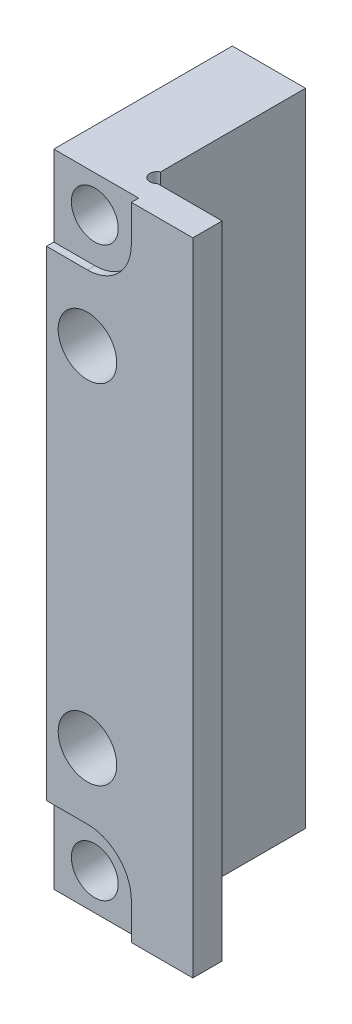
ISO-10303-21;
HEADER;
FILE_DESCRIPTION(('STEP AP214'),'2;1');
FILE_NAME('part.step','',(''),(''),'','','');
FILE_SCHEMA(('AUTOMOTIVE_DESIGN { 1 0 10303 214 1 1 1 1 }'));
ENDSEC;
DATA;
#1=APPLICATION_CONTEXT('core data for automotive mechanical design processes');
#2=APPLICATION_PROTOCOL_DEFINITION('international standard','automotive_design',2000,#1);
#3=PRODUCT_CONTEXT('',#1,'mechanical');
#4=PRODUCT('Part','Part','',(#3));
#5=PRODUCT_RELATED_PRODUCT_CATEGORY('part','',(#4));
#6=PRODUCT_DEFINITION_FORMATION('','',#4);
#7=PRODUCT_DEFINITION_CONTEXT('part definition',#1,'design');
#8=PRODUCT_DEFINITION('design','',#6,#7);
#9=PRODUCT_DEFINITION_SHAPE('','',#8);
#10=(LENGTH_UNIT() NAMED_UNIT(*) SI_UNIT(.MILLI.,.METRE.));
#11=(NAMED_UNIT(*) PLANE_ANGLE_UNIT() SI_UNIT($,.RADIAN.));
#12=(NAMED_UNIT(*) SI_UNIT($,.STERADIAN.) SOLID_ANGLE_UNIT());
#13=UNCERTAINTY_MEASURE_WITH_UNIT(LENGTH_MEASURE(1.E-05),#10,'distance_accuracy_value','');
#14=(GEOMETRIC_REPRESENTATION_CONTEXT(3) GLOBAL_UNCERTAINTY_ASSIGNED_CONTEXT((#13)) GLOBAL_UNIT_ASSIGNED_CONTEXT((#10,
#11,#12)) REPRESENTATION_CONTEXT('',''));
#15=CARTESIAN_POINT('',(0.,0.,0.));
#16=DIRECTION('',(0.,0.,1.));
#17=DIRECTION('',(1.,0.,0.));
#18=AXIS2_PLACEMENT_3D('',#15,#16,#17);
#19=CARTESIAN_POINT('',(-34.9,21.9,-10.));
#20=DIRECTION('',(-1.,0.,0.));
#21=DIRECTION('',(0.,0.,1.));
#22=AXIS2_PLACEMENT_3D('',#19,#20,#21);
#23=PLANE('',#22);
#24=DIRECTION('',(0.,0.,1.));
#25=VECTOR('',#24,1.);
#26=CARTESIAN_POINT('',(-34.9,16.4,-0.5));
#27=LINE('',#26,#25);
#28=CARTESIAN_POINT('',(-34.9,16.4,-0.5));
#29=VERTEX_POINT('',#28);
#30=CARTESIAN_POINT('',(-34.9,16.4,0.));
#31=VERTEX_POINT('',#30);
#32=EDGE_CURVE('E248',#29,#31,#27,.T.);
#33=ORIENTED_EDGE('',*,*,#32,.F.);
#34=DIRECTION('',(0.,-1.,0.));
#35=VECTOR('',#34,1.);
#36=CARTESIAN_POINT('',(-34.9,16.4,-0.5));
#37=LINE('',#36,#35);
#38=CARTESIAN_POINT('',(-34.9,21.9,-0.5));
#39=VERTEX_POINT('',#38);
#40=EDGE_CURVE('E228',#39,#29,#37,.T.);
#41=ORIENTED_EDGE('',*,*,#40,.F.);
#42=DIRECTION('',(0.,0.,1.));
#43=VECTOR('',#42,1.);
#44=CARTESIAN_POINT('',(-34.9,21.9,-10.));
#45=LINE('',#44,#43);
#46=CARTESIAN_POINT('',(-34.9,21.9,-12.7));
#47=VERTEX_POINT('',#46);
#48=EDGE_CURVE('E12',#47,#39,#45,.T.);
#49=ORIENTED_EDGE('',*,*,#48,.F.);
#50=DIRECTION('',(0.,1.,0.));
#51=VECTOR('',#50,1.);
#52=CARTESIAN_POINT('',(-34.9,-21.9,-12.7));
#53=LINE('',#52,#51);
#54=CARTESIAN_POINT('',(-34.9,-21.9,-12.7));
#55=VERTEX_POINT('',#54);
#56=EDGE_CURVE('E201',#55,#47,#53,.T.);
#57=ORIENTED_EDGE('',*,*,#56,.F.);
#58=DIRECTION('',(0.,0.,1.));
#59=VECTOR('',#58,1.);
#60=CARTESIAN_POINT('',(-34.9,-21.9,-10.));
#61=LINE('',#60,#59);
#62=CARTESIAN_POINT('',(-34.9,-21.9,-0.5));
#63=VERTEX_POINT('',#62);
#64=EDGE_CURVE('E341',#55,#63,#61,.T.);
#65=ORIENTED_EDGE('',*,*,#64,.T.);
#66=DIRECTION('',(0.,-1.,0.));
#67=VECTOR('',#66,1.);
#68=CARTESIAN_POINT('',(-34.9,-16.4,-0.5));
#69=LINE('',#68,#67);
#70=CARTESIAN_POINT('',(-34.9,-16.4,-0.5));
#71=VERTEX_POINT('',#70);
#72=EDGE_CURVE('E285',#71,#63,#69,.T.);
#73=ORIENTED_EDGE('',*,*,#72,.F.);
#74=DIRECTION('',(0.,0.,1.));
#75=VECTOR('',#74,1.);
#76=CARTESIAN_POINT('',(-34.9,-16.4,-0.5));
#77=LINE('',#76,#75);
#78=CARTESIAN_POINT('',(-34.9,-16.4,0.));
#79=VERTEX_POINT('',#78);
#80=EDGE_CURVE('E260',#71,#79,#77,.T.);
#81=ORIENTED_EDGE('',*,*,#80,.T.);
#82=DIRECTION('',(0.,-1.,0.));
#83=VECTOR('',#82,1.);
#84=CARTESIAN_POINT('',(-34.9,21.9,0.));
#85=LINE('',#84,#83);
#86=EDGE_CURVE('E327',#31,#79,#85,.T.);
#87=ORIENTED_EDGE('',*,*,#86,.F.);
#88=EDGE_LOOP('',(#33,#41,#49,#57,#65,#73,#81,#87));
#89=FACE_BOUND('',#88,.T.);
#90=ADVANCED_FACE('F62',(#89),#23,.T.);
#91=CARTESIAN_POINT('',(-34.9,21.9,-10.));
#92=DIRECTION('',(0.,1.,0.));
#93=DIRECTION('',(-1.,0.,0.));
#94=AXIS2_PLACEMENT_3D('',#91,#92,#93);
#95=PLANE('',#94);
#96=DIRECTION('',(0.,0.,1.));
#97=VECTOR('',#96,1.);
#98=CARTESIAN_POINT('',(-29.1,21.9,-0.5));
#99=LINE('',#98,#97);
#100=CARTESIAN_POINT('',(-29.1,21.9,-0.5));
#101=VERTEX_POINT('',#100);
#102=CARTESIAN_POINT('',(-29.1,21.9,0.));
#103=VERTEX_POINT('',#102);
#104=EDGE_CURVE('E251',#101,#103,#99,.T.);
#105=ORIENTED_EDGE('',*,*,#104,.T.);
#106=DIRECTION('',(-1.,0.,0.));
#107=VECTOR('',#106,1.);
#108=CARTESIAN_POINT('',(-34.9,21.9,0.));
#109=LINE('',#108,#107);
#110=CARTESIAN_POINT('',(-24.9,21.9,0.));
#111=VERTEX_POINT('',#110);
#112=EDGE_CURVE('E338',#111,#103,#109,.T.);
#113=ORIENTED_EDGE('',*,*,#112,.F.);
#114=DIRECTION('',(0.,0.,1.));
#115=VECTOR('',#114,1.);
#116=CARTESIAN_POINT('',(-24.9,21.9,-10.));
#117=LINE('',#116,#115);
#118=CARTESIAN_POINT('',(-24.8999999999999,21.9,-2.));
#119=VERTEX_POINT('',#118);
#120=EDGE_CURVE('E71',#119,#111,#117,.T.);
#121=ORIENTED_EDGE('',*,*,#120,.F.);
#122=DIRECTION('',(-1.,0.,0.));
#123=VECTOR('',#122,1.);
#124=CARTESIAN_POINT('',(0.,21.8999999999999,-2.));
#125=LINE('',#124,#123);
#126=CARTESIAN_POINT('',(-29.3226741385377,21.9,-2.));
#127=VERTEX_POINT('',#126);
#128=EDGE_CURVE('E183',#119,#127,#125,.T.);
#129=ORIENTED_EDGE('',*,*,#128,.T.);
#130=CARTESIAN_POINT('',(-29.6839888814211,21.9,-2.34561778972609));
#131=DIRECTION('',(0.,-1.,0.));
#132=DIRECTION('',(1.,0.,0.));
#133=AXIS2_PLACEMENT_3D('',#130,#131,#132);
#134=CIRCLE('',#133,0.499999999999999);
#135=CARTESIAN_POINT('',(-29.8999999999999,21.9,-2.79654926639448));
#136=VERTEX_POINT('',#135);
#137=EDGE_CURVE('E180',#127,#136,#134,.T.);
#138=ORIENTED_EDGE('',*,*,#137,.T.);
#139=DIRECTION('',(0.,0.,-1.));
#140=VECTOR('',#139,1.);
#141=CARTESIAN_POINT('',(-29.8999999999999,21.9,0.));
#142=LINE('',#141,#140);
#143=CARTESIAN_POINT('',(-29.8999999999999,21.9,-12.7));
#144=VERTEX_POINT('',#143);
#145=EDGE_CURVE('E172',#136,#144,#142,.T.);
#146=ORIENTED_EDGE('',*,*,#145,.T.);
#147=DIRECTION('',(1.,0.,0.));
#148=VECTOR('',#147,1.);
#149=CARTESIAN_POINT('',(-34.9,21.9,-12.7));
#150=LINE('',#149,#148);
#151=EDGE_CURVE('E177',#47,#144,#150,.T.);
#152=ORIENTED_EDGE('',*,*,#151,.F.);
#153=ORIENTED_EDGE('',*,*,#48,.T.);
#154=DIRECTION('',(-1.,0.,0.));
#155=VECTOR('',#154,1.);
#156=CARTESIAN_POINT('',(-29.1,21.9,-0.5));
#157=LINE('',#156,#155);
#158=EDGE_CURVE('E225',#101,#39,#157,.T.);
#159=ORIENTED_EDGE('',*,*,#158,.F.);
#160=EDGE_LOOP('',(#105,#113,#121,#129,#138,#146,#152,#153,#159));
#161=FACE_BOUND('',#160,.T.);
#162=ADVANCED_FACE('F175',(#161),#95,.T.);
#163=CARTESIAN_POINT('',(-24.9,21.9,-10.));
#164=DIRECTION('',(1.,0.,0.));
#165=DIRECTION('',(0.,1.,0.));
#166=AXIS2_PLACEMENT_3D('',#163,#164,#165);
#167=PLANE('',#166);
#168=DIRECTION('',(0.,-1.,0.));
#169=VECTOR('',#168,1.);
#170=CARTESIAN_POINT('',(-24.8999999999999,21.9,-2.));
#171=LINE('',#170,#169);
#172=CARTESIAN_POINT('',(-24.9,-21.9,-2.));
#173=VERTEX_POINT('',#172);
#174=EDGE_CURVE('E306',#119,#173,#171,.T.);
#175=ORIENTED_EDGE('',*,*,#174,.F.);
#176=ORIENTED_EDGE('',*,*,#120,.T.);
#177=DIRECTION('',(0.,1.,0.));
#178=VECTOR('',#177,1.);
#179=CARTESIAN_POINT('',(-24.9,21.9,0.));
#180=LINE('',#179,#178);
#181=CARTESIAN_POINT('',(-24.9,-21.9,0.));
#182=VERTEX_POINT('',#181);
#183=EDGE_CURVE('E334',#182,#111,#180,.T.);
#184=ORIENTED_EDGE('',*,*,#183,.F.);
#185=DIRECTION('',(0.,0.,1.));
#186=VECTOR('',#185,1.);
#187=CARTESIAN_POINT('',(-24.9,-21.9,-10.));
#188=LINE('',#187,#186);
#189=EDGE_CURVE('E345',#173,#182,#188,.T.);
#190=ORIENTED_EDGE('',*,*,#189,.F.);
#191=EDGE_LOOP('',(#175,#176,#184,#190));
#192=FACE_BOUND('',#191,.T.);
#193=ADVANCED_FACE('F398',(#192),#167,.T.);
#194=CARTESIAN_POINT('',(-24.9,-21.9,-10.));
#195=DIRECTION('',(0.,-1.,0.));
#196=DIRECTION('',(1.,0.,0.));
#197=AXIS2_PLACEMENT_3D('',#194,#195,#196);
#198=PLANE('',#197);
#199=DIRECTION('',(0.,0.,1.));
#200=VECTOR('',#199,1.);
#201=CARTESIAN_POINT('',(-29.1,-21.9,-0.5));
#202=LINE('',#201,#200);
#203=CARTESIAN_POINT('',(-29.1,-21.9,-0.5));
#204=VERTEX_POINT('',#203);
#205=CARTESIAN_POINT('',(-29.1,-21.9,0.));
#206=VERTEX_POINT('',#205);
#207=EDGE_CURVE('E264',#204,#206,#202,.T.);
#208=ORIENTED_EDGE('',*,*,#207,.F.);
#209=DIRECTION('',(1.,0.,0.));
#210=VECTOR('',#209,1.);
#211=CARTESIAN_POINT('',(-29.1,-21.9,-0.5));
#212=LINE('',#211,#210);
#213=EDGE_CURVE('E282',#63,#204,#212,.T.);
#214=ORIENTED_EDGE('',*,*,#213,.F.);
#215=ORIENTED_EDGE('',*,*,#64,.F.);
#216=DIRECTION('',(-1.,0.,0.));
#217=VECTOR('',#216,1.);
#218=CARTESIAN_POINT('',(-29.9,-21.9,-12.7));
#219=LINE('',#218,#217);
#220=CARTESIAN_POINT('',(-29.9,-21.9,-12.7));
#221=VERTEX_POINT('',#220);
#222=EDGE_CURVE('E195',#221,#55,#219,.T.);
#223=ORIENTED_EDGE('',*,*,#222,.F.);
#224=DIRECTION('',(0.,0.,-1.));
#225=VECTOR('',#224,1.);
#226=CARTESIAN_POINT('',(-29.9,-21.9,0.));
#227=LINE('',#226,#225);
#228=CARTESIAN_POINT('',(-29.9,-21.9,-2.79654926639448));
#229=VERTEX_POINT('',#228);
#230=EDGE_CURVE('E190',#229,#221,#227,.T.);
#231=ORIENTED_EDGE('',*,*,#230,.F.);
#232=CARTESIAN_POINT('',(-29.6839888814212,-21.9,-2.34561778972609));
#233=DIRECTION('',(0.,-1.,0.));
#234=DIRECTION('',(1.,0.,0.));
#235=AXIS2_PLACEMENT_3D('',#232,#233,#234);
#236=CIRCLE('',#235,0.499999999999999);
#237=CARTESIAN_POINT('',(-29.3226741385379,-21.9,-2.));
#238=VERTEX_POINT('',#237);
#239=EDGE_CURVE('E317',#238,#229,#236,.T.);
#240=ORIENTED_EDGE('',*,*,#239,.F.);
#241=DIRECTION('',(-1.,0.,0.));
#242=VECTOR('',#241,1.);
#243=CARTESIAN_POINT('',(0.,-21.9000000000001,-2.));
#244=LINE('',#243,#242);
#245=EDGE_CURVE('E184',#173,#238,#244,.T.);
#246=ORIENTED_EDGE('',*,*,#245,.F.);
#247=ORIENTED_EDGE('',*,*,#189,.T.);
#248=DIRECTION('',(1.,0.,0.));
#249=VECTOR('',#248,1.);
#250=CARTESIAN_POINT('',(-24.9,-21.9,0.));
#251=LINE('',#250,#249);
#252=EDGE_CURVE('E331',#206,#182,#251,.T.);
#253=ORIENTED_EDGE('',*,*,#252,.F.);
#254=EDGE_LOOP('',(#208,#214,#215,#223,#231,#240,#246,#247,#253));
#255=FACE_BOUND('',#254,.T.);
#256=ADVANCED_FACE('F594',(#255),#198,.T.);
#257=CARTESIAN_POINT('',(0.,0.,0.));
#258=DIRECTION('',(0.,0.,-1.));
#259=DIRECTION('',(-1.,0.,0.));
#260=AXIS2_PLACEMENT_3D('',#257,#258,#259);
#261=PLANE('',#260);
#262=CARTESIAN_POINT('',(-32.1,11.9,0.));
#263=DIRECTION('',(0.,0.,1.));
#264=DIRECTION('',(1.,0.,0.));
#265=AXIS2_PLACEMENT_3D('',#262,#263,#264);
#266=CIRCLE('',#265,2.);
#267=CARTESIAN_POINT('',(-30.1,11.9,0.));
#268=VERTEX_POINT('',#267);
#269=EDGE_CURVE('E295',#268,#268,#266,.T.);
#270=ORIENTED_EDGE('',*,*,#269,.F.);
#271=EDGE_LOOP('',(#270));
#272=FACE_BOUND('',#271,.T.);
#273=CARTESIAN_POINT('',(-32.1,-11.9,0.));
#274=DIRECTION('',(0.,0.,1.));
#275=DIRECTION('',(-1.,0.,0.));
#276=AXIS2_PLACEMENT_3D('',#273,#274,#275);
#277=CIRCLE('',#276,2.);
#278=CARTESIAN_POINT('',(-34.1,-11.9,0.));
#279=VERTEX_POINT('',#278);
#280=EDGE_CURVE('E300',#279,#279,#277,.T.);
#281=ORIENTED_EDGE('',*,*,#280,.F.);
#282=EDGE_LOOP('',(#281));
#283=FACE_BOUND('',#282,.T.);
#284=CARTESIAN_POINT('',(-32.1,19.4,0.));
#285=DIRECTION('',(0.,0.,1.));
#286=DIRECTION('',(-1.,0.,0.));
#287=AXIS2_PLACEMENT_3D('',#284,#285,#286);
#288=CIRCLE('',#287,2.99999999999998);
#289=CARTESIAN_POINT('',(-32.1,16.4,0.));
#290=VERTEX_POINT('',#289);
#291=CARTESIAN_POINT('',(-29.1,19.4,0.));
#292=VERTEX_POINT('',#291);
#293=EDGE_CURVE('E79',#290,#292,#288,.T.);
#294=ORIENTED_EDGE('',*,*,#293,.F.);
#295=DIRECTION('',(1.,0.,0.));
#296=VECTOR('',#295,1.);
#297=CARTESIAN_POINT('',(-32.1,16.4,0.));
#298=LINE('',#297,#296);
#299=EDGE_CURVE('E221',#31,#290,#298,.T.);
#300=ORIENTED_EDGE('',*,*,#299,.F.);
#301=ORIENTED_EDGE('',*,*,#86,.T.);
#302=DIRECTION('',(-1.,0.,0.));
#303=VECTOR('',#302,1.);
#304=CARTESIAN_POINT('',(-32.1,-16.4,0.));
#305=LINE('',#304,#303);
#306=CARTESIAN_POINT('',(-32.1,-16.4,0.));
#307=VERTEX_POINT('',#306);
#308=EDGE_CURVE('E273',#307,#79,#305,.T.);
#309=ORIENTED_EDGE('',*,*,#308,.F.);
#310=CARTESIAN_POINT('',(-32.1,-19.4,0.));
#311=DIRECTION('',(0.,0.,1.));
#312=DIRECTION('',(-1.,0.,0.));
#313=AXIS2_PLACEMENT_3D('',#310,#311,#312);
#314=CIRCLE('',#313,3.00000000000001);
#315=CARTESIAN_POINT('',(-29.1,-19.4,0.));
#316=VERTEX_POINT('',#315);
#317=EDGE_CURVE('E87',#316,#307,#314,.T.);
#318=ORIENTED_EDGE('',*,*,#317,.F.);
#319=DIRECTION('',(0.,1.,0.));
#320=VECTOR('',#319,1.);
#321=CARTESIAN_POINT('',(-29.1,-19.4,0.));
#322=LINE('',#321,#320);
#323=EDGE_CURVE('E269',#206,#316,#322,.T.);
#324=ORIENTED_EDGE('',*,*,#323,.F.);
#325=ORIENTED_EDGE('',*,*,#252,.T.);
#326=ORIENTED_EDGE('',*,*,#183,.T.);
#327=ORIENTED_EDGE('',*,*,#112,.T.);
#328=DIRECTION('',(0.,1.,0.));
#329=VECTOR('',#328,1.);
#330=CARTESIAN_POINT('',(-29.1,19.4,0.));
#331=LINE('',#330,#329);
#332=EDGE_CURVE('E238',#292,#103,#331,.T.);
#333=ORIENTED_EDGE('',*,*,#332,.F.);
#334=EDGE_LOOP('',(#294,#300,#301,#309,#318,#324,#325,#326,#327,#333));
#335=FACE_BOUND('',#334,.T.);
#336=ADVANCED_FACE('F386',(#272,#283,#335),#261,.F.);
#337=CARTESIAN_POINT('',(0.,21.8999999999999,-2.));
#338=DIRECTION('',(0.,0.,1.));
#339=DIRECTION('',(1.,0.,0.));
#340=AXIS2_PLACEMENT_3D('',#337,#338,#339);
#341=PLANE('',#340);
#342=DIRECTION('',(0.,-1.,0.));
#343=VECTOR('',#342,1.);
#344=CARTESIAN_POINT('',(-29.3226741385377,21.9,-2.));
#345=LINE('',#344,#343);
#346=EDGE_CURVE('E314',#238,#127,#345,.F.);
#347=ORIENTED_EDGE('',*,*,#346,.T.);
#348=ORIENTED_EDGE('',*,*,#128,.F.);
#349=ORIENTED_EDGE('',*,*,#174,.T.);
#350=ORIENTED_EDGE('',*,*,#245,.T.);
#351=EDGE_LOOP('',(#347,#348,#349,#350));
#352=FACE_BOUND('',#351,.T.);
#353=ADVANCED_FACE('F384',(#352),#341,.F.);
#354=CARTESIAN_POINT('',(-29.8999999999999,21.9,0.));
#355=DIRECTION('',(-1.,0.,0.));
#356=DIRECTION('',(0.,-1.,0.));
#357=AXIS2_PLACEMENT_3D('',#354,#355,#356);
#358=PLANE('',#357);
#359=DIRECTION('',(0.,-1.,0.));
#360=VECTOR('',#359,1.);
#361=CARTESIAN_POINT('',(-29.8999999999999,21.9,-2.79654926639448));
#362=LINE('',#361,#360);
#363=EDGE_CURVE('E324',#136,#229,#362,.T.);
#364=ORIENTED_EDGE('',*,*,#363,.T.);
#365=ORIENTED_EDGE('',*,*,#230,.T.);
#366=DIRECTION('',(0.,-1.,0.));
#367=VECTOR('',#366,1.);
#368=CARTESIAN_POINT('',(-29.8999999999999,21.9,-12.7));
#369=LINE('',#368,#367);
#370=EDGE_CURVE('E187',#144,#221,#369,.T.);
#371=ORIENTED_EDGE('',*,*,#370,.F.);
#372=ORIENTED_EDGE('',*,*,#145,.F.);
#373=EDGE_LOOP('',(#364,#365,#371,#372));
#374=FACE_BOUND('',#373,.T.);
#375=ADVANCED_FACE('F188',(#374),#358,.F.);
#376=CARTESIAN_POINT('',(-29.6839888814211,21.9,-2.34561778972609));
#377=DIRECTION('',(0.,-1.,0.));
#378=DIRECTION('',(1.,0.,0.));
#379=AXIS2_PLACEMENT_3D('',#376,#377,#378);
#380=CYLINDRICAL_SURFACE('',#379,0.499999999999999);
#381=CARTESIAN_POINT('',(-30.1,11.9,-2.62298892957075));
#382=CARTESIAN_POINT('',(-30.1000000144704,11.8709885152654,-2.62298896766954));
#383=CARTESIAN_POINT('',(-30.1006322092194,11.8419764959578,-2.62204766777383));
#384=CARTESIAN_POINT('',(-30.1031491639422,11.7841365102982,-2.61821644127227));
#385=CARTESIAN_POINT('',(-30.1050337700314,11.7553085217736,-2.61532675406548));
#386=CARTESIAN_POINT('',(-30.1100169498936,11.6980227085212,-2.60738545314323));
#387=CARTESIAN_POINT('',(-30.1131167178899,11.669565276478,-2.60233171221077));
#388=CARTESIAN_POINT('',(-30.120440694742,11.6133919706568,-2.58967514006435));
#389=CARTESIAN_POINT('',(-30.1246632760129,11.5856750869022,-2.58207599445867));
#390=CARTESIAN_POINT('',(-30.1337031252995,11.5334955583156,-2.56436132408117));
#391=CARTESIAN_POINT('',(-30.1384526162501,11.508944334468,-2.55447555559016));
#392=CARTESIAN_POINT('',(-30.1484595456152,11.4617525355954,-2.53117039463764));
#393=CARTESIAN_POINT('',(-30.1537137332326,11.4391012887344,-2.5177727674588));
#394=CARTESIAN_POINT('',(-30.1612342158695,11.4087935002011,-2.49491974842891));
#395=CARTESIAN_POINT('',(-30.1635555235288,11.399738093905,-2.48734479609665));
#396=CARTESIAN_POINT('',(-30.1680643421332,11.38260030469,-2.4710871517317));
#397=CARTESIAN_POINT('',(-30.1702516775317,11.3745191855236,-2.46240305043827));
#398=CARTESIAN_POINT('',(-30.174365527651,11.3596367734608,-2.44371718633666));
#399=CARTESIAN_POINT('',(-30.1762880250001,11.3528546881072,-2.4336988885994));
#400=CARTESIAN_POINT('',(-30.179611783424,11.34130006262,-2.4124884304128));
#401=CARTESIAN_POINT('',(-30.1810149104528,11.3365203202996,-2.40130066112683));
#402=CARTESIAN_POINT('',(-30.1827404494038,11.3306829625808,-2.38180836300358));
#403=CARTESIAN_POINT('',(-30.1832651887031,11.3289230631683,-2.37373105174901));
#404=CARTESIAN_POINT('',(-30.1839171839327,11.3267391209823,-2.35738118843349));
#405=CARTESIAN_POINT('',(-30.184044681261,11.3263142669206,-2.34910875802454));
#406=CARTESIAN_POINT('',(-30.1838877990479,11.3268385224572,-2.33261035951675));
#407=CARTESIAN_POINT('',(-30.1836033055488,11.3277880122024,-2.32438440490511));
#408=CARTESIAN_POINT('',(-30.1826536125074,11.3309784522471,-2.30821050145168));
#409=CARTESIAN_POINT('',(-30.181988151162,11.3332202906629,-2.3002627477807));
#410=CARTESIAN_POINT('',(-30.1801174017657,11.3395855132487,-2.28274029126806));
#411=CARTESIAN_POINT('',(-30.1788151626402,11.3440524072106,-2.27330146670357));
#412=CARTESIAN_POINT('',(-30.1758495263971,11.3544048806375,-2.25530290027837));
#413=CARTESIAN_POINT('',(-30.174185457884,11.3602930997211,-2.24674483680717));
#414=CARTESIAN_POINT('',(-30.1697325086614,11.3763904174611,-2.22641084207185));
#415=CARTESIAN_POINT('',(-30.1668013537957,11.3872758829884,-2.21520580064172));
#416=CARTESIAN_POINT('',(-30.160764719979,11.4105986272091,-2.194622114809));
#417=CARTESIAN_POINT('',(-30.1576588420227,11.4230395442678,-2.18524788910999));
#418=CARTESIAN_POINT('',(-30.1490706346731,11.4590564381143,-2.16131521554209));
#419=CARTESIAN_POINT('',(-30.1436267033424,11.4837406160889,-2.14842558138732));
#420=CARTESIAN_POINT('',(-30.1334532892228,11.534787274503,-2.12623693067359));
#421=CARTESIAN_POINT('',(-30.1287257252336,11.5611540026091,-2.11694745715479));
#422=CARTESIAN_POINT('',(-30.1206243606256,11.6124506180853,-2.10186501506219));
#423=CARTESIAN_POINT('',(-30.1171674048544,11.6372987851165,-2.09583401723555));
#424=CARTESIAN_POINT('',(-30.111159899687,11.6875002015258,-2.08569707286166));
#425=CARTESIAN_POINT('',(-30.108610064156,11.7128538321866,-2.08159264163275));
#426=CARTESIAN_POINT('',(-30.1024033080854,11.7894251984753,-2.07176642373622));
#427=CARTESIAN_POINT('',(-30.1001987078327,11.8410938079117,-2.0685475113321));
#428=CARTESIAN_POINT('',(-30.0998154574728,11.9477783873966,-2.06796685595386));
#429=CARTESIAN_POINT('',(-30.1019017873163,12.0027982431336,-2.07099066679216));
#430=CARTESIAN_POINT('',(-30.1083230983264,12.0843081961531,-2.08113173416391));
#431=CARTESIAN_POINT('',(-30.1110102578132,12.1112965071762,-2.08544317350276));
#432=CARTESIAN_POINT('',(-30.1174121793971,12.1646989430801,-2.09624852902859));
#433=CARTESIAN_POINT('',(-30.1211259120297,12.1911136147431,-2.10274026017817));
#434=CARTESIAN_POINT('',(-30.1294669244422,12.243065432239,-2.11839891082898));
#435=CARTESIAN_POINT('',(-30.1340961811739,12.2686005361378,-2.12757164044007));
#436=CARTESIAN_POINT('',(-30.1440112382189,12.3180115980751,-2.14934040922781));
#437=CARTESIAN_POINT('',(-30.1492943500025,12.3418937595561,-2.16192266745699));
#438=CARTESIAN_POINT('',(-30.1572345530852,12.3751750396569,-2.18407331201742));
#439=CARTESIAN_POINT('',(-30.1598542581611,12.3857397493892,-2.19189717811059));
#440=CARTESIAN_POINT('',(-30.1649964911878,12.405833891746,-2.20883179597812));
#441=CARTESIAN_POINT('',(-30.1675190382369,12.4153635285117,-2.21794229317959));
#442=CARTESIAN_POINT('',(-30.1718895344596,12.4314583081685,-2.23596425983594));
#443=CARTESIAN_POINT('',(-30.1737799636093,12.4382529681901,-2.24465785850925));
#444=CARTESIAN_POINT('',(-30.1772154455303,12.4503992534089,-2.26306666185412));
#445=CARTESIAN_POINT('',(-30.1787611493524,12.4557536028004,-2.27277988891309));
#446=CARTESIAN_POINT('',(-30.1810307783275,12.4635332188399,-2.2907437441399));
#447=CARTESIAN_POINT('',(-30.1818621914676,12.4663499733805,-2.29880997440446));
#448=CARTESIAN_POINT('',(-30.1831385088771,12.4706550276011,-2.31532007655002));
#449=CARTESIAN_POINT('',(-30.1835837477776,12.4721444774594,-2.323763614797));
#450=CARTESIAN_POINT('',(-30.1840389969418,12.4736672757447,-2.34082781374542));
#451=CARTESIAN_POINT('',(-30.18404734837,12.4736950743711,-2.34944902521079));
#452=CARTESIAN_POINT('',(-30.1836235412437,12.4722776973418,-2.3665585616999));
#453=CARTESIAN_POINT('',(-30.1831912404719,12.4708320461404,-2.37504684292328));
#454=CARTESIAN_POINT('',(-30.1819663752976,12.4667020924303,-2.39123863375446));
#455=CARTESIAN_POINT('',(-30.1811923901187,12.4640815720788,-2.39896022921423));
#456=CARTESIAN_POINT('',(-30.1793580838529,12.4578040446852,-2.41392818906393));
#457=CARTESIAN_POINT('',(-30.1782976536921,12.4541466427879,-2.42117437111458));
#458=CARTESIAN_POINT('',(-30.1752816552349,12.4436026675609,-2.43919636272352));
#459=CARTESIAN_POINT('',(-30.1731644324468,12.4360759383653,-2.4495701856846));
#460=CARTESIAN_POINT('',(-30.1686362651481,12.4195272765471,-2.46897332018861));
#461=CARTESIAN_POINT('',(-30.1662245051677,12.4105011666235,-2.47799873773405));
#462=CARTESIAN_POINT('',(-30.1596471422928,12.385073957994,-2.5004207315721));
#463=CARTESIAN_POINT('',(-30.1553804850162,12.3677559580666,-2.51273963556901));
#464=CARTESIAN_POINT('',(-30.1470073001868,12.3314765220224,-2.53469518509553));
#465=CARTESIAN_POINT('',(-30.1429012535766,12.3125106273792,-2.54432423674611));
#466=CARTESIAN_POINT('',(-30.1317114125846,12.2566583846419,-2.56891468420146));
#467=CARTESIAN_POINT('',(-30.1251398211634,12.2185183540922,-2.58124076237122));
#468=CARTESIAN_POINT('',(-30.1141489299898,12.1407368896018,-2.60072605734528));
#469=CARTESIAN_POINT('',(-30.1097313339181,12.1010942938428,-2.60788118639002));
#470=CARTESIAN_POINT('',(-30.1043458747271,12.0344618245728,-2.61638467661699));
#471=CARTESIAN_POINT('',(-30.1027188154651,12.0076626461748,-2.61887387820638));
#472=CARTESIAN_POINT('',(-30.1005456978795,11.9539091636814,-2.62217625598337));
#473=CARTESIAN_POINT('',(-30.0999999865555,11.9269548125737,-2.62298889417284));
#474=CARTESIAN_POINT('',(-30.1,11.9,-2.62298892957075));
#475=B_SPLINE_CURVE_WITH_KNOTS('',3,(#381,#382,#383,#384,#385,#386,#387,#388,#389,#390,#391,
#392,#393,#394,#395,#396,#397,#398,#399,#400,#401,#402,#403,#404,#405,#406,#407,#408,#409,#410,
#411,#412,#413,#414,#415,#416,#417,#418,#419,#420,#421,#422,#423,#424,#425,#426,#427,#428,#429,
#430,#431,#432,#433,#434,#435,#436,#437,#438,#439,#440,#441,#442,#443,#444,#445,#446,#447,#448,
#449,#450,#451,#452,#453,#454,#455,#456,#457,#458,#459,#460,#461,#462,#463,#464,#465,#466,#467,
#468,#469,#470,#471,#472,#473,#474),.UNSPECIFIED.,.T.,.F.,(4,2,2,2,2,2,2,2,2,2,2,2,2,2,2,2,2,2,
2,2,2,2,2,2,2,2,2,2,2,2,2,2,2,2,2,2,2,2,2,2,2,2,2,2,2,2,4),(0.,0.087012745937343,
0.17401480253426,0.261102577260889,0.348064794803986,0.428545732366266,0.508539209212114,
0.544566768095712,0.580640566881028,0.617212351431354,0.653651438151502,0.678394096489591,
0.703121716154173,0.727856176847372,0.752607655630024,0.784002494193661,0.815456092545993,
0.862871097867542,0.910399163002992,0.995045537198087,1.07991477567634,1.15721118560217,
1.23456829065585,1.38946763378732,1.55421900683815,1.63652198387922,1.71874272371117,
1.80114298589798,1.88321503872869,1.92335563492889,1.96348830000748,1.99696092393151,
2.03036978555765,2.05601774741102,2.08164346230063,2.10736646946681,2.13309778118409,
2.15757539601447,2.18206234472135,2.22080954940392,2.25966657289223,2.32432900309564,
2.38917218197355,2.51035066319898,2.6316248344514,2.71244317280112,2.79328744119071),.UNSPECIFIED.);
#476=CARTESIAN_POINT('',(-30.1,11.9,-2.62298892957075));
#477=VERTEX_POINT('',#476);
#478=EDGE_CURVE('E321',#477,#477,#475,.T.);
#479=ORIENTED_EDGE('',*,*,#478,.T.);
#480=EDGE_LOOP('',(#479));
#481=FACE_BOUND('',#480,.T.);
#482=CARTESIAN_POINT('',(-30.1,-11.9,-2.62298892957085));
#483=CARTESIAN_POINT('',(-30.1000000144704,-11.9290114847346,-2.62298896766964));
#484=CARTESIAN_POINT('',(-30.1006322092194,-11.9580235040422,-2.62204766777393));
#485=CARTESIAN_POINT('',(-30.1031491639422,-12.0158634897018,-2.61821644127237));
#486=CARTESIAN_POINT('',(-30.1050337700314,-12.0446914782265,-2.61532675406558));
#487=CARTESIAN_POINT('',(-30.1100169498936,-12.1019772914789,-2.60738545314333));
#488=CARTESIAN_POINT('',(-30.1131167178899,-12.1304347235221,-2.60233171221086));
#489=CARTESIAN_POINT('',(-30.120440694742,-12.1866080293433,-2.58967514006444));
#490=CARTESIAN_POINT('',(-30.1246632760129,-12.2143249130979,-2.58207599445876));
#491=CARTESIAN_POINT('',(-30.1337031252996,-12.2665044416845,-2.56436132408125));
#492=CARTESIAN_POINT('',(-30.1384526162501,-12.2910556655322,-2.55447555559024));
#493=CARTESIAN_POINT('',(-30.1484595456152,-12.3382474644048,-2.53117039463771));
#494=CARTESIAN_POINT('',(-30.1537137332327,-12.3608987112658,-2.51777276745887));
#495=CARTESIAN_POINT('',(-30.1612342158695,-12.3912064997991,-2.49491974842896));
#496=CARTESIAN_POINT('',(-30.1635555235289,-12.4002619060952,-2.4873447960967));
#497=CARTESIAN_POINT('',(-30.1680643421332,-12.4173996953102,-2.47108715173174));
#498=CARTESIAN_POINT('',(-30.1702516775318,-12.4254808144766,-2.46240305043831));
#499=CARTESIAN_POINT('',(-30.174365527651,-12.4403632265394,-2.4437171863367));
#500=CARTESIAN_POINT('',(-30.1762880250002,-12.4471453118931,-2.43369888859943));
#501=CARTESIAN_POINT('',(-30.179611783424,-12.4586999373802,-2.41248843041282));
#502=CARTESIAN_POINT('',(-30.1810149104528,-12.4634796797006,-2.40130066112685));
#503=CARTESIAN_POINT('',(-30.1827404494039,-12.4693170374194,-2.38180836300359));
#504=CARTESIAN_POINT('',(-30.1832651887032,-12.4710769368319,-2.37373105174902));
#505=CARTESIAN_POINT('',(-30.1839171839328,-12.473260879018,-2.35738118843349));
#506=CARTESIAN_POINT('',(-30.1840446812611,-12.4736857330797,-2.34910875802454));
#507=CARTESIAN_POINT('',(-30.1838877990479,-12.4731614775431,-2.33261035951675));
#508=CARTESIAN_POINT('',(-30.1836033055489,-12.4722119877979,-2.3243844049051));
#509=CARTESIAN_POINT('',(-30.1826536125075,-12.4690215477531,-2.30821050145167));
#510=CARTESIAN_POINT('',(-30.181988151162,-12.4667797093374,-2.30026274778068));
#511=CARTESIAN_POINT('',(-30.1801174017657,-12.4604144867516,-2.28274029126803));
#512=CARTESIAN_POINT('',(-30.1788151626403,-12.4559475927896,-2.27330146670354));
#513=CARTESIAN_POINT('',(-30.1758495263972,-12.4455951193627,-2.25530290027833));
#514=CARTESIAN_POINT('',(-30.1741854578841,-12.4397069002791,-2.24674483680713));
#515=CARTESIAN_POINT('',(-30.1697325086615,-12.4236095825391,-2.2264108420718));
#516=CARTESIAN_POINT('',(-30.1668013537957,-12.4127241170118,-2.21520580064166));
#517=CARTESIAN_POINT('',(-30.1607647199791,-12.3894013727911,-2.19462211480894));
#518=CARTESIAN_POINT('',(-30.1576588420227,-12.3769604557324,-2.18524788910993));
#519=CARTESIAN_POINT('',(-30.1490706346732,-12.3409435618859,-2.16131521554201));
#520=CARTESIAN_POINT('',(-30.1436267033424,-12.3162593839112,-2.14842558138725));
#521=CARTESIAN_POINT('',(-30.1334532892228,-12.2652127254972,-2.12623693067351));
#522=CARTESIAN_POINT('',(-30.1287257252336,-12.2388459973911,-2.1169474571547));
#523=CARTESIAN_POINT('',(-30.1206243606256,-12.1875493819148,-2.1018650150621));
#524=CARTESIAN_POINT('',(-30.1171674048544,-12.1627012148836,-2.09583401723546));
#525=CARTESIAN_POINT('',(-30.111159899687,-12.1124997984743,-2.08569707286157));
#526=CARTESIAN_POINT('',(-30.108610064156,-12.0871461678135,-2.08159264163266));
#527=CARTESIAN_POINT('',(-30.1024033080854,-12.0105748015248,-2.07176642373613));
#528=CARTESIAN_POINT('',(-30.1001987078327,-11.9589061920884,-2.068547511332));
#529=CARTESIAN_POINT('',(-30.0998154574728,-11.8522216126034,-2.06796685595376));
#530=CARTESIAN_POINT('',(-30.1019017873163,-11.7972017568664,-2.07099066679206));
#531=CARTESIAN_POINT('',(-30.1083230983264,-11.7156918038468,-2.08113173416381));
#532=CARTESIAN_POINT('',(-30.1110102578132,-11.6887034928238,-2.08544317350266));
#533=CARTESIAN_POINT('',(-30.1174121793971,-11.6353010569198,-2.09624852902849));
#534=CARTESIAN_POINT('',(-30.1211259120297,-11.6088863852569,-2.10274026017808));
#535=CARTESIAN_POINT('',(-30.1294669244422,-11.556934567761,-2.11839891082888));
#536=CARTESIAN_POINT('',(-30.134096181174,-11.5313994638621,-2.12757164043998));
#537=CARTESIAN_POINT('',(-30.1440112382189,-11.4819884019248,-2.14934040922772));
#538=CARTESIAN_POINT('',(-30.1492943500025,-11.4581062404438,-2.16192266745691));
#539=CARTESIAN_POINT('',(-30.1572345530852,-11.424824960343,-2.18407331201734));
#540=CARTESIAN_POINT('',(-30.1598542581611,-11.4142602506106,-2.19189717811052));
#541=CARTESIAN_POINT('',(-30.1649964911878,-11.3941661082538,-2.20883179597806));
#542=CARTESIAN_POINT('',(-30.1675190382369,-11.3846364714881,-2.21794229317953));
#543=CARTESIAN_POINT('',(-30.1718895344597,-11.3685416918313,-2.23596425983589));
#544=CARTESIAN_POINT('',(-30.1737799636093,-11.3617470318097,-2.2446578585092));
#545=CARTESIAN_POINT('',(-30.1772154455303,-11.3496007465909,-2.26306666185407));
#546=CARTESIAN_POINT('',(-30.1787611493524,-11.3442463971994,-2.27277988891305));
#547=CARTESIAN_POINT('',(-30.1810307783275,-11.33646678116,-2.29074374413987));
#548=CARTESIAN_POINT('',(-30.1818621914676,-11.3336500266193,-2.29880997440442));
#549=CARTESIAN_POINT('',(-30.1831385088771,-11.3293449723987,-2.31532007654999));
#550=CARTESIAN_POINT('',(-30.1835837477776,-11.3278555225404,-2.32376361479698));
#551=CARTESIAN_POINT('',(-30.1840389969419,-11.3263327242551,-2.3408278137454));
#552=CARTESIAN_POINT('',(-30.18404734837,-11.3263049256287,-2.34944902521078));
#553=CARTESIAN_POINT('',(-30.1836235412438,-11.327722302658,-2.36655856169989));
#554=CARTESIAN_POINT('',(-30.183191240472,-11.3291679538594,-2.37504684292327));
#555=CARTESIAN_POINT('',(-30.1819663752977,-11.3332979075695,-2.39123863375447));
#556=CARTESIAN_POINT('',(-30.1811923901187,-11.335918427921,-2.39896022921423));
#557=CARTESIAN_POINT('',(-30.1793580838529,-11.3421959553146,-2.41392818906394));
#558=CARTESIAN_POINT('',(-30.1782976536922,-11.3458533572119,-2.4211743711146));
#559=CARTESIAN_POINT('',(-30.175281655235,-11.3563973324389,-2.43919636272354));
#560=CARTESIAN_POINT('',(-30.1731644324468,-11.3639240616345,-2.44957018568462));
#561=CARTESIAN_POINT('',(-30.1686362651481,-11.3804727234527,-2.46897332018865));
#562=CARTESIAN_POINT('',(-30.1662245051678,-11.3894988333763,-2.47799873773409));
#563=CARTESIAN_POINT('',(-30.1596471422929,-11.4149260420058,-2.50042073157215));
#564=CARTESIAN_POINT('',(-30.1553804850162,-11.4322440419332,-2.51273963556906));
#565=CARTESIAN_POINT('',(-30.1470073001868,-11.4685234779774,-2.53469518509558));
#566=CARTESIAN_POINT('',(-30.1429012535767,-11.4874893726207,-2.54432423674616));
#567=CARTESIAN_POINT('',(-30.1317114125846,-11.543341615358,-2.56891468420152));
#568=CARTESIAN_POINT('',(-30.1251398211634,-11.5814816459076,-2.58124076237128));
#569=CARTESIAN_POINT('',(-30.1141489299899,-11.6592631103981,-2.60072605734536));
#570=CARTESIAN_POINT('',(-30.1097313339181,-11.6989057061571,-2.6078811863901));
#571=CARTESIAN_POINT('',(-30.1043458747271,-11.7655381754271,-2.61638467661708));
#572=CARTESIAN_POINT('',(-30.1027188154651,-11.7923373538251,-2.61887387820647));
#573=CARTESIAN_POINT('',(-30.1005456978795,-11.8460908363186,-2.62217625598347));
#574=CARTESIAN_POINT('',(-30.0999999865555,-11.8730451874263,-2.62298889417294));
#575=CARTESIAN_POINT('',(-30.1,-11.9,-2.62298892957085));
#576=B_SPLINE_CURVE_WITH_KNOTS('',3,(#482,#483,#484,#485,#486,#487,#488,#489,#490,#491,#492,
#493,#494,#495,#496,#497,#498,#499,#500,#501,#502,#503,#504,#505,#506,#507,#508,#509,#510,#511,
#512,#513,#514,#515,#516,#517,#518,#519,#520,#521,#522,#523,#524,#525,#526,#527,#528,#529,#530,
#531,#532,#533,#534,#535,#536,#537,#538,#539,#540,#541,#542,#543,#544,#545,#546,#547,#548,#549,
#550,#551,#552,#553,#554,#555,#556,#557,#558,#559,#560,#561,#562,#563,#564,#565,#566,#567,#568,
#569,#570,#571,#572,#573,#574,#575),.UNSPECIFIED.,.T.,.F.,(4,2,2,2,2,2,2,2,2,2,2,2,2,2,2,2,2,2,
2,2,2,2,2,2,2,2,2,2,2,2,2,2,2,2,2,2,2,2,2,2,2,2,2,2,2,2,4),(0.,0.0870127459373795,
0.174014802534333,0.261102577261,0.348064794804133,0.42854573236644,0.508539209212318,
0.544566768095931,0.580640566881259,0.617212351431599,0.65365143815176,0.678394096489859,
0.70312171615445,0.727856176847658,0.752607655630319,0.784002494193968,0.815456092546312,
0.862871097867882,0.910399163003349,0.995045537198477,1.07991477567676,1.15721118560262,
1.23456829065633,1.38946763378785,1.55421900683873,1.63652198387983,1.71874272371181,
1.80114298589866,1.8832150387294,1.92335563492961,1.96348830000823,1.99696092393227,
2.03036978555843,2.05601774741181,2.08164346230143,2.10736646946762,2.13309778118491,
2.1575753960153,2.18206234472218,2.22080954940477,2.25966657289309,2.32432900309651,
2.38917218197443,2.51035066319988,2.63162483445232,2.71244317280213,2.7932874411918),.UNSPECIFIED.);
#577=CARTESIAN_POINT('',(-30.1,-11.9,-2.62298892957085));
#578=VERTEX_POINT('',#577);
#579=EDGE_CURVE('E299',#578,#578,#576,.T.);
#580=ORIENTED_EDGE('',*,*,#579,.T.);
#581=EDGE_LOOP('',(#580));
#582=FACE_BOUND('',#581,.T.);
#583=ORIENTED_EDGE('',*,*,#137,.F.);
#584=ORIENTED_EDGE('',*,*,#346,.F.);
#585=ORIENTED_EDGE('',*,*,#239,.T.);
#586=ORIENTED_EDGE('',*,*,#363,.F.);
#587=EDGE_LOOP('',(#583,#584,#585,#586));
#588=FACE_BOUND('',#587,.T.);
#589=ADVANCED_FACE('F364',(#481,#582,#588),#380,.F.);
#590=CARTESIAN_POINT('',(-32.1,-19.4,-10.));
#591=DIRECTION('',(0.,0.,1.));
#592=DIRECTION('',(1.,0.,0.));
#593=AXIS2_PLACEMENT_3D('',#590,#591,#592);
#594=CYLINDRICAL_SURFACE('',#593,1.6);
#595=CARTESIAN_POINT('',(-32.1,-19.4,-0.5));
#596=DIRECTION('',(0.,0.,-1.));
#597=DIRECTION('',(-1.,0.,0.));
#598=AXIS2_PLACEMENT_3D('',#595,#596,#597);
#599=CIRCLE('',#598,1.6);
#600=CARTESIAN_POINT('',(-33.7,-19.4,-0.5));
#601=VERTEX_POINT('',#600);
#602=EDGE_CURVE('E65',#601,#601,#599,.F.);
#603=ORIENTED_EDGE('',*,*,#602,.T.);
#604=EDGE_LOOP('',(#603));
#605=FACE_BOUND('',#604,.T.);
#606=CARTESIAN_POINT('',(-32.1,-19.4,-12.7));
#607=DIRECTION('',(0.,0.,-1.));
#608=DIRECTION('',(-1.,0.,0.));
#609=AXIS2_PLACEMENT_3D('',#606,#607,#608);
#610=CIRCLE('',#609,1.6);
#611=CARTESIAN_POINT('',(-33.7,-19.4,-12.7));
#612=VERTEX_POINT('',#611);
#613=EDGE_CURVE('E470',#612,#612,#610,.T.);
#614=ORIENTED_EDGE('',*,*,#613,.T.);
#615=EDGE_LOOP('',(#614));
#616=FACE_BOUND('',#615,.T.);
#617=ADVANCED_FACE('F379',(#605,#616),#594,.F.);
#618=CARTESIAN_POINT('',(-32.1,19.4,-10.));
#619=DIRECTION('',(0.,0.,1.));
#620=DIRECTION('',(1.,0.,0.));
#621=AXIS2_PLACEMENT_3D('',#618,#619,#620);
#622=CYLINDRICAL_SURFACE('',#621,1.6);
#623=CARTESIAN_POINT('',(-32.1,19.4,-0.5));
#624=DIRECTION('',(0.,0.,-1.));
#625=DIRECTION('',(-1.,0.,0.));
#626=AXIS2_PLACEMENT_3D('',#623,#624,#625);
#627=CIRCLE('',#626,1.6);
#628=CARTESIAN_POINT('',(-33.7,19.4,-0.5));
#629=VERTEX_POINT('',#628);
#630=EDGE_CURVE('E247',#629,#629,#627,.F.);
#631=ORIENTED_EDGE('',*,*,#630,.T.);
#632=EDGE_LOOP('',(#631));
#633=FACE_BOUND('',#632,.T.);
#634=CARTESIAN_POINT('',(-32.1,19.4,-12.7));
#635=DIRECTION('',(0.,0.,-1.));
#636=DIRECTION('',(-1.,0.,0.));
#637=AXIS2_PLACEMENT_3D('',#634,#635,#636);
#638=CIRCLE('',#637,1.6);
#639=CARTESIAN_POINT('',(-33.7,19.4,-12.7));
#640=VERTEX_POINT('',#639);
#641=EDGE_CURVE('E203',#640,#640,#638,.T.);
#642=ORIENTED_EDGE('',*,*,#641,.T.);
#643=EDGE_LOOP('',(#642));
#644=FACE_BOUND('',#643,.T.);
#645=ADVANCED_FACE('F373',(#633,#644),#622,.F.);
#646=CARTESIAN_POINT('',(-32.1,-11.9,-10.));
#647=DIRECTION('',(0.,0.,1.));
#648=DIRECTION('',(1.,0.,0.));
#649=AXIS2_PLACEMENT_3D('',#646,#647,#648);
#650=CYLINDRICAL_SURFACE('',#649,2.);
#651=ORIENTED_EDGE('',*,*,#280,.T.);
#652=EDGE_LOOP('',(#651));
#653=FACE_BOUND('',#652,.T.);
#654=ORIENTED_EDGE('',*,*,#579,.F.);
#655=EDGE_LOOP('',(#654));
#656=FACE_BOUND('',#655,.T.);
#657=CARTESIAN_POINT('',(-32.1,-11.9,-12.7));
#658=DIRECTION('',(0.,0.,-1.));
#659=DIRECTION('',(-1.,0.,0.));
#660=AXIS2_PLACEMENT_3D('',#657,#658,#659);
#661=CIRCLE('',#660,2.);
#662=CARTESIAN_POINT('',(-34.1,-11.9,-12.7));
#663=VERTEX_POINT('',#662);
#664=EDGE_CURVE('E467',#663,#663,#661,.T.);
#665=ORIENTED_EDGE('',*,*,#664,.T.);
#666=EDGE_LOOP('',(#665));
#667=FACE_BOUND('',#666,.T.);
#668=ADVANCED_FACE('F368',(#653,#656,#667),#650,.F.);
#669=CARTESIAN_POINT('',(-32.1,11.9,-10.));
#670=DIRECTION('',(0.,0.,1.));
#671=DIRECTION('',(1.,0.,0.));
#672=AXIS2_PLACEMENT_3D('',#669,#670,#671);
#673=CYLINDRICAL_SURFACE('',#672,2.);
#674=ORIENTED_EDGE('',*,*,#269,.T.);
#675=EDGE_LOOP('',(#674));
#676=FACE_BOUND('',#675,.T.);
#677=ORIENTED_EDGE('',*,*,#478,.F.);
#678=EDGE_LOOP('',(#677));
#679=FACE_BOUND('',#678,.T.);
#680=CARTESIAN_POINT('',(-32.1,11.9,-12.7));
#681=DIRECTION('',(0.,0.,-1.));
#682=DIRECTION('',(-1.,0.,0.));
#683=AXIS2_PLACEMENT_3D('',#680,#681,#682);
#684=CIRCLE('',#683,2.);
#685=CARTESIAN_POINT('',(-34.1,11.9,-12.7));
#686=VERTEX_POINT('',#685);
#687=EDGE_CURVE('E207',#686,#686,#684,.T.);
#688=ORIENTED_EDGE('',*,*,#687,.T.);
#689=EDGE_LOOP('',(#688));
#690=FACE_BOUND('',#689,.T.);
#691=ADVANCED_FACE('F372',(#676,#679,#690),#673,.F.);
#692=CARTESIAN_POINT('',(-32.1,19.4,-0.5));
#693=DIRECTION('',(0.,0.,-1.));
#694=DIRECTION('',(-1.,0.,0.));
#695=AXIS2_PLACEMENT_3D('',#692,#693,#694);
#696=PLANE('',#695);
#697=CARTESIAN_POINT('',(-32.1,19.4,-0.5));
#698=DIRECTION('',(0.,0.,1.));
#699=DIRECTION('',(-1.,0.,0.));
#700=AXIS2_PLACEMENT_3D('',#697,#698,#699);
#701=CIRCLE('',#700,2.99999999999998);
#702=CARTESIAN_POINT('',(-32.1,16.4,-0.5));
#703=VERTEX_POINT('',#702);
#704=CARTESIAN_POINT('',(-29.1,19.4,-0.5));
#705=VERTEX_POINT('',#704);
#706=EDGE_CURVE('E216',#703,#705,#701,.T.);
#707=ORIENTED_EDGE('',*,*,#706,.T.);
#708=DIRECTION('',(0.,1.,0.));
#709=VECTOR('',#708,1.);
#710=CARTESIAN_POINT('',(-29.1,19.4,-0.5));
#711=LINE('',#710,#709);
#712=EDGE_CURVE('E220',#705,#101,#711,.T.);
#713=ORIENTED_EDGE('',*,*,#712,.T.);
#714=ORIENTED_EDGE('',*,*,#158,.T.);
#715=ORIENTED_EDGE('',*,*,#40,.T.);
#716=DIRECTION('',(1.,0.,0.));
#717=VECTOR('',#716,1.);
#718=CARTESIAN_POINT('',(-32.1,16.4,-0.5));
#719=LINE('',#718,#717);
#720=EDGE_CURVE('E231',#29,#703,#719,.T.);
#721=ORIENTED_EDGE('',*,*,#720,.T.);
#722=EDGE_LOOP('',(#707,#713,#714,#715,#721));
#723=FACE_BOUND('',#722,.T.);
#724=ORIENTED_EDGE('',*,*,#630,.F.);
#725=EDGE_LOOP('',(#724));
#726=FACE_BOUND('',#725,.T.);
#727=ADVANCED_FACE('F417',(#723,#726),#696,.F.);
#728=CARTESIAN_POINT('',(-32.1,19.4,-0.5));
#729=DIRECTION('',(0.,0.,1.));
#730=DIRECTION('',(1.,0.,0.));
#731=AXIS2_PLACEMENT_3D('',#728,#729,#730);
#732=CYLINDRICAL_SURFACE('',#731,2.99999999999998);
#733=ORIENTED_EDGE('',*,*,#293,.T.);
#734=DIRECTION('',(0.,0.,1.));
#735=VECTOR('',#734,1.);
#736=CARTESIAN_POINT('',(-29.1,19.4,-0.5));
#737=LINE('',#736,#735);
#738=EDGE_CURVE('E235',#705,#292,#737,.T.);
#739=ORIENTED_EDGE('',*,*,#738,.F.);
#740=ORIENTED_EDGE('',*,*,#706,.F.);
#741=DIRECTION('',(0.,0.,1.));
#742=VECTOR('',#741,1.);
#743=CARTESIAN_POINT('',(-32.1,16.4,-0.5));
#744=LINE('',#743,#742);
#745=EDGE_CURVE('E244',#703,#290,#744,.T.);
#746=ORIENTED_EDGE('',*,*,#745,.T.);
#747=EDGE_LOOP('',(#733,#739,#740,#746));
#748=FACE_BOUND('',#747,.T.);
#749=ADVANCED_FACE('F420',(#748),#732,.F.);
#750=CARTESIAN_POINT('',(-32.1,16.4,-0.5));
#751=DIRECTION('',(0.,-1.,0.));
#752=DIRECTION('',(0.,0.,-1.));
#753=AXIS2_PLACEMENT_3D('',#750,#751,#752);
#754=PLANE('',#753);
#755=ORIENTED_EDGE('',*,*,#299,.T.);
#756=ORIENTED_EDGE('',*,*,#745,.F.);
#757=ORIENTED_EDGE('',*,*,#720,.F.);
#758=ORIENTED_EDGE('',*,*,#32,.T.);
#759=EDGE_LOOP('',(#755,#756,#757,#758));
#760=FACE_BOUND('',#759,.T.);
#761=ADVANCED_FACE('F406',(#760),#754,.F.);
#762=CARTESIAN_POINT('',(-29.1,19.4,-0.5));
#763=DIRECTION('',(1.,0.,0.));
#764=DIRECTION('',(0.,0.,-1.));
#765=AXIS2_PLACEMENT_3D('',#762,#763,#764);
#766=PLANE('',#765);
#767=ORIENTED_EDGE('',*,*,#332,.T.);
#768=ORIENTED_EDGE('',*,*,#104,.F.);
#769=ORIENTED_EDGE('',*,*,#712,.F.);
#770=ORIENTED_EDGE('',*,*,#738,.T.);
#771=EDGE_LOOP('',(#767,#768,#769,#770));
#772=FACE_BOUND('',#771,.T.);
#773=ADVANCED_FACE('F412',(#772),#766,.F.);
#774=CARTESIAN_POINT('',(-32.1,-19.4,-0.5));
#775=DIRECTION('',(0.,0.,-1.));
#776=DIRECTION('',(-1.,0.,0.));
#777=AXIS2_PLACEMENT_3D('',#774,#775,#776);
#778=PLANE('',#777);
#779=CARTESIAN_POINT('',(-32.1,-19.4,-0.5));
#780=DIRECTION('',(0.,0.,1.));
#781=DIRECTION('',(-1.,0.,0.));
#782=AXIS2_PLACEMENT_3D('',#779,#780,#781);
#783=CIRCLE('',#782,3.00000000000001);
#784=CARTESIAN_POINT('',(-29.1,-19.4,-0.5));
#785=VERTEX_POINT('',#784);
#786=CARTESIAN_POINT('',(-32.1,-16.4,-0.5));
#787=VERTEX_POINT('',#786);
#788=EDGE_CURVE('E274',#785,#787,#783,.T.);
#789=ORIENTED_EDGE('',*,*,#788,.T.);
#790=DIRECTION('',(-1.,0.,0.));
#791=VECTOR('',#790,1.);
#792=CARTESIAN_POINT('',(-32.1,-16.4,-0.5));
#793=LINE('',#792,#791);
#794=EDGE_CURVE('E288',#787,#71,#793,.T.);
#795=ORIENTED_EDGE('',*,*,#794,.T.);
#796=ORIENTED_EDGE('',*,*,#72,.T.);
#797=ORIENTED_EDGE('',*,*,#213,.T.);
#798=DIRECTION('',(0.,1.,0.));
#799=VECTOR('',#798,1.);
#800=CARTESIAN_POINT('',(-29.1,-19.4,-0.5));
#801=LINE('',#800,#799);
#802=EDGE_CURVE('E259',#204,#785,#801,.T.);
#803=ORIENTED_EDGE('',*,*,#802,.T.);
#804=EDGE_LOOP('',(#789,#795,#796,#797,#803));
#805=FACE_BOUND('',#804,.T.);
#806=ORIENTED_EDGE('',*,*,#602,.F.);
#807=EDGE_LOOP('',(#806));
#808=FACE_BOUND('',#807,.T.);
#809=ADVANCED_FACE('F435',(#805,#808),#778,.F.);
#810=CARTESIAN_POINT('',(-32.1,-19.4,-0.5));
#811=DIRECTION('',(0.,0.,1.));
#812=DIRECTION('',(1.,0.,0.));
#813=AXIS2_PLACEMENT_3D('',#810,#811,#812);
#814=CYLINDRICAL_SURFACE('',#813,3.00000000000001);
#815=ORIENTED_EDGE('',*,*,#317,.T.);
#816=DIRECTION('',(0.,0.,1.));
#817=VECTOR('',#816,1.);
#818=CARTESIAN_POINT('',(-32.1,-16.4,-0.5));
#819=LINE('',#818,#817);
#820=EDGE_CURVE('E256',#787,#307,#819,.T.);
#821=ORIENTED_EDGE('',*,*,#820,.F.);
#822=ORIENTED_EDGE('',*,*,#788,.F.);
#823=DIRECTION('',(0.,0.,1.));
#824=VECTOR('',#823,1.);
#825=CARTESIAN_POINT('',(-29.1,-19.4,-0.5));
#826=LINE('',#825,#824);
#827=EDGE_CURVE('E215',#785,#316,#826,.T.);
#828=ORIENTED_EDGE('',*,*,#827,.T.);
#829=EDGE_LOOP('',(#815,#821,#822,#828));
#830=FACE_BOUND('',#829,.T.);
#831=ADVANCED_FACE('F431',(#830),#814,.F.);
#832=CARTESIAN_POINT('',(-29.1,-19.4,-0.5));
#833=DIRECTION('',(1.,0.,0.));
#834=DIRECTION('',(0.,0.,-1.));
#835=AXIS2_PLACEMENT_3D('',#832,#833,#834);
#836=PLANE('',#835);
#837=ORIENTED_EDGE('',*,*,#323,.T.);
#838=ORIENTED_EDGE('',*,*,#827,.F.);
#839=ORIENTED_EDGE('',*,*,#802,.F.);
#840=ORIENTED_EDGE('',*,*,#207,.T.);
#841=EDGE_LOOP('',(#837,#838,#839,#840));
#842=FACE_BOUND('',#841,.T.);
#843=ADVANCED_FACE('F434',(#842),#836,.F.);
#844=CARTESIAN_POINT('',(-32.1,-16.4,-0.5));
#845=DIRECTION('',(0.,1.,0.));
#846=DIRECTION('',(0.,0.,1.));
#847=AXIS2_PLACEMENT_3D('',#844,#845,#846);
#848=PLANE('',#847);
#849=ORIENTED_EDGE('',*,*,#308,.T.);
#850=ORIENTED_EDGE('',*,*,#80,.F.);
#851=ORIENTED_EDGE('',*,*,#794,.F.);
#852=ORIENTED_EDGE('',*,*,#820,.T.);
#853=EDGE_LOOP('',(#849,#850,#851,#852));
#854=FACE_BOUND('',#853,.T.);
#855=ADVANCED_FACE('F436',(#854),#848,.F.);
#856=CARTESIAN_POINT('',(0.,0.,-12.7));
#857=DIRECTION('',(0.,0.,-1.));
#858=DIRECTION('',(-1.,0.,0.));
#859=AXIS2_PLACEMENT_3D('',#856,#857,#858);
#860=PLANE('',#859);
#861=ORIENTED_EDGE('',*,*,#664,.F.);
#862=EDGE_LOOP('',(#861));
#863=FACE_BOUND('',#862,.T.);
#864=ORIENTED_EDGE('',*,*,#641,.F.);
#865=EDGE_LOOP('',(#864));
#866=FACE_BOUND('',#865,.T.);
#867=ORIENTED_EDGE('',*,*,#151,.T.);
#868=ORIENTED_EDGE('',*,*,#370,.T.);
#869=ORIENTED_EDGE('',*,*,#222,.T.);
#870=ORIENTED_EDGE('',*,*,#56,.T.);
#871=EDGE_LOOP('',(#867,#868,#869,#870));
#872=FACE_BOUND('',#871,.T.);
#873=ORIENTED_EDGE('',*,*,#687,.F.);
#874=EDGE_LOOP('',(#873));
#875=FACE_BOUND('',#874,.T.);
#876=ORIENTED_EDGE('',*,*,#613,.F.);
#877=EDGE_LOOP('',(#876));
#878=FACE_BOUND('',#877,.T.);
#879=ADVANCED_FACE('F198',(#863,#866,#872,#875,#878),#860,.T.);
#880=CLOSED_SHELL('',(#90,#162,#193,#256,#336,#353,#375,#589,#617,#645,#668,#691,#727,#749,#761,
#773,#809,#831,#843,#855,#879));
#881=MANIFOLD_SOLID_BREP('B2',#880);
#882=ADVANCED_BREP_SHAPE_REPRESENTATION('',(#18,#881),#14);
#883=SHAPE_DEFINITION_REPRESENTATION(#9,#882);
ENDSEC;
END-ISO-10303-21;
